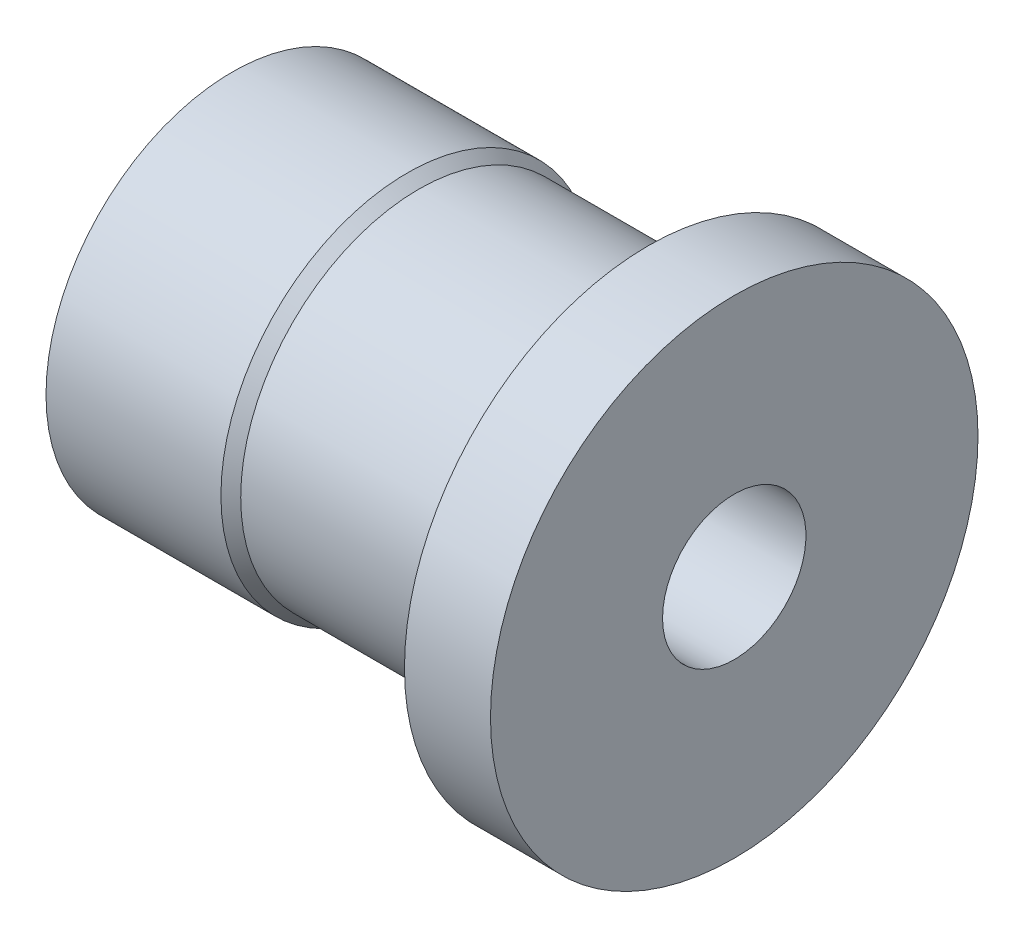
from build123d import *

# Parameters (mm, degrees)
SCHIZZO2_R               = 1.5
TAGLIO_ESTRUSIONE1_DEPTH = 10


with BuildPart() as part:
    # Schizzo1 → Rivoluzione1 (revolve)
    with BuildSketch(Plane(origin=(0, 0, 0), x_dir=(1, 0, 0), z_dir=(0, 1, 0)), mode=Mode.PRIVATE) as rivoluzione1_sk:
        Polygon((-8.75, 2.5), (8.75, 2.5), (8.75, 8.5), (5.75, 8.5), (5.75, 6.21), (-2.25, 6.21), (-2.650533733, 6.5), (-8.75, 6.5), align=None)
    revolve(rivoluzione1_sk.sketch.rotate(Axis((-8.75, 0, 0), (1, 0, 0)), 180), axis=Axis((-8.75, 0, 0), (1, 0, 0)))

    # Schizzo2 → Taglio-Estrusione1 (cut)
    with BuildSketch(Plane(origin=(0, 0, 0), x_dir=(1, 0, 0), z_dir=(0, 1, 0))):
        with Locations(Location((-5.75, 0, 0), (0, 0, 270))):
            Circle(SCHIZZO2_R)
    extrude(amount=-TAGLIO_ESTRUSIONE1_DEPTH, mode=Mode.SUBTRACT)


solid = part.part
